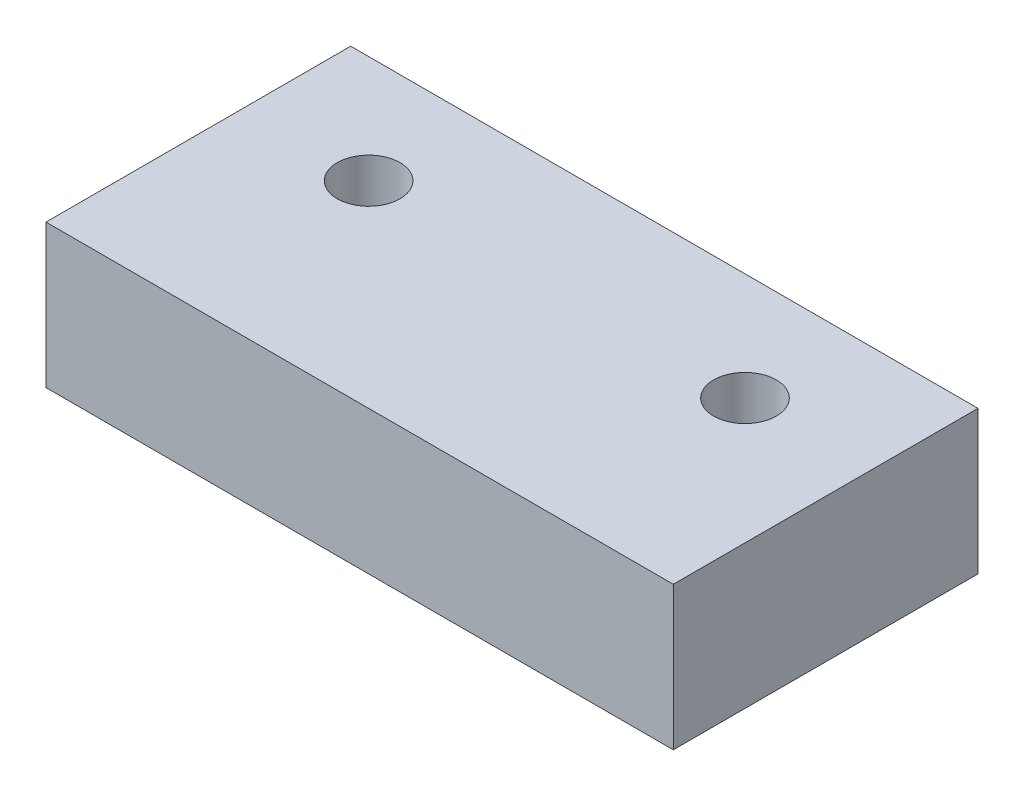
ISO-10303-21;
HEADER;
FILE_DESCRIPTION(('STEP AP214'),'2;1');
FILE_NAME('part.step','',(''),(''),'','','');
FILE_SCHEMA(('AUTOMOTIVE_DESIGN { 1 0 10303 214 1 1 1 1 }'));
ENDSEC;
DATA;
#1=APPLICATION_CONTEXT('core data for automotive mechanical design processes');
#2=APPLICATION_PROTOCOL_DEFINITION('international standard','automotive_design',2000,#1);
#3=PRODUCT_CONTEXT('',#1,'mechanical');
#4=PRODUCT('Part','Part','',(#3));
#5=PRODUCT_RELATED_PRODUCT_CATEGORY('part','',(#4));
#6=PRODUCT_DEFINITION_FORMATION('','',#4);
#7=PRODUCT_DEFINITION_CONTEXT('part definition',#1,'design');
#8=PRODUCT_DEFINITION('design','',#6,#7);
#9=PRODUCT_DEFINITION_SHAPE('','',#8);
#10=(LENGTH_UNIT() NAMED_UNIT(*) SI_UNIT(.MILLI.,.METRE.));
#11=(NAMED_UNIT(*) PLANE_ANGLE_UNIT() SI_UNIT($,.RADIAN.));
#12=(NAMED_UNIT(*) SI_UNIT($,.STERADIAN.) SOLID_ANGLE_UNIT());
#13=UNCERTAINTY_MEASURE_WITH_UNIT(LENGTH_MEASURE(1.E-05),#10,'distance_accuracy_value','');
#14=(GEOMETRIC_REPRESENTATION_CONTEXT(3) GLOBAL_UNCERTAINTY_ASSIGNED_CONTEXT((#13)) GLOBAL_UNIT_ASSIGNED_CONTEXT((#10,
#11,#12)) REPRESENTATION_CONTEXT('',''));
#15=CARTESIAN_POINT('',(0.,0.,0.));
#16=DIRECTION('',(0.,0.,1.));
#17=DIRECTION('',(1.,0.,0.));
#18=AXIS2_PLACEMENT_3D('',#15,#16,#17);
#19=CARTESIAN_POINT('',(10.5,3.,0.));
#20=DIRECTION('',(0.,-1.,0.));
#21=DIRECTION('',(0.,0.,-1.));
#22=AXIS2_PLACEMENT_3D('',#19,#20,#21);
#23=CYLINDRICAL_SURFACE('',#22,3.5);
#24=CARTESIAN_POINT('',(10.5,3.,0.));
#25=DIRECTION('',(0.,-1.,0.));
#26=DIRECTION('',(0.,0.,-1.));
#27=AXIS2_PLACEMENT_3D('',#24,#25,#26);
#28=CIRCLE('',#27,3.5);
#29=CARTESIAN_POINT('',(10.5,3.,-3.5));
#30=VERTEX_POINT('',#29);
#31=EDGE_CURVE('E20',#30,#30,#28,.T.);
#32=ORIENTED_EDGE('',*,*,#31,.F.);
#33=EDGE_LOOP('',(#32));
#34=FACE_BOUND('',#33,.T.);
#35=CARTESIAN_POINT('',(10.5,0.,0.));
#36=DIRECTION('',(0.,-1.,0.));
#37=DIRECTION('',(0.,0.,-1.));
#38=AXIS2_PLACEMENT_3D('',#35,#36,#37);
#39=CIRCLE('',#38,3.5);
#40=CARTESIAN_POINT('',(10.5,0.,-3.5));
#41=VERTEX_POINT('',#40);
#42=EDGE_CURVE('E99',#41,#41,#39,.T.);
#43=ORIENTED_EDGE('',*,*,#42,.T.);
#44=EDGE_LOOP('',(#43));
#45=FACE_BOUND('',#44,.T.);
#46=ADVANCED_FACE('F17',(#34,#45),#23,.F.);
#47=CARTESIAN_POINT('',(-10.5,3.,0.));
#48=DIRECTION('',(0.,-1.,0.));
#49=DIRECTION('',(0.,0.,-1.));
#50=AXIS2_PLACEMENT_3D('',#47,#48,#49);
#51=CYLINDRICAL_SURFACE('',#50,3.5);
#52=CARTESIAN_POINT('',(-10.5,3.,0.));
#53=DIRECTION('',(0.,-1.,0.));
#54=DIRECTION('',(0.,0.,-1.));
#55=AXIS2_PLACEMENT_3D('',#52,#53,#54);
#56=CIRCLE('',#55,3.5);
#57=CARTESIAN_POINT('',(-10.5,3.,-3.5));
#58=VERTEX_POINT('',#57);
#59=EDGE_CURVE('E101',#58,#58,#56,.T.);
#60=ORIENTED_EDGE('',*,*,#59,.F.);
#61=EDGE_LOOP('',(#60));
#62=FACE_BOUND('',#61,.T.);
#63=CARTESIAN_POINT('',(-10.5,0.,0.));
#64=DIRECTION('',(0.,-1.,0.));
#65=DIRECTION('',(0.,0.,-1.));
#66=AXIS2_PLACEMENT_3D('',#63,#64,#65);
#67=CIRCLE('',#66,3.5);
#68=CARTESIAN_POINT('',(-10.5,0.,-3.5));
#69=VERTEX_POINT('',#68);
#70=EDGE_CURVE('E96',#69,#69,#67,.T.);
#71=ORIENTED_EDGE('',*,*,#70,.T.);
#72=EDGE_LOOP('',(#71));
#73=FACE_BOUND('',#72,.T.);
#74=ADVANCED_FACE('F112',(#62,#73),#51,.F.);
#75=CARTESIAN_POINT('',(10.5,3.,0.));
#76=DIRECTION('',(0.,-1.,0.));
#77=DIRECTION('',(0.,0.,-1.));
#78=AXIS2_PLACEMENT_3D('',#75,#76,#77);
#79=PLANE('',#78);
#80=CARTESIAN_POINT('',(10.5,3.,0.));
#81=DIRECTION('',(0.,1.,0.));
#82=DIRECTION('',(0.,0.,1.));
#83=AXIS2_PLACEMENT_3D('',#80,#81,#82);
#84=CIRCLE('',#83,1.75);
#85=CARTESIAN_POINT('',(10.5,3.,1.75));
#86=VERTEX_POINT('',#85);
#87=EDGE_CURVE('E93',#86,#86,#84,.T.);
#88=ORIENTED_EDGE('',*,*,#87,.T.);
#89=EDGE_LOOP('',(#88));
#90=FACE_BOUND('',#89,.T.);
#91=ORIENTED_EDGE('',*,*,#31,.T.);
#92=EDGE_LOOP('',(#91));
#93=FACE_BOUND('',#92,.T.);
#94=ADVANCED_FACE('F108',(#90,#93),#79,.T.);
#95=CARTESIAN_POINT('',(-10.5,3.,0.));
#96=DIRECTION('',(0.,-1.,0.));
#97=DIRECTION('',(0.,0.,-1.));
#98=AXIS2_PLACEMENT_3D('',#95,#96,#97);
#99=PLANE('',#98);
#100=CARTESIAN_POINT('',(-10.5,3.,0.));
#101=DIRECTION('',(0.,1.,0.));
#102=DIRECTION('',(0.,0.,1.));
#103=AXIS2_PLACEMENT_3D('',#100,#101,#102);
#104=CIRCLE('',#103,1.75);
#105=CARTESIAN_POINT('',(-10.5,3.,1.75));
#106=VERTEX_POINT('',#105);
#107=EDGE_CURVE('E69',#106,#106,#104,.T.);
#108=ORIENTED_EDGE('',*,*,#107,.T.);
#109=EDGE_LOOP('',(#108));
#110=FACE_BOUND('',#109,.T.);
#111=ORIENTED_EDGE('',*,*,#59,.T.);
#112=EDGE_LOOP('',(#111));
#113=FACE_BOUND('',#112,.T.);
#114=ADVANCED_FACE('F117',(#110,#113),#99,.T.);
#115=CARTESIAN_POINT('',(0.,0.,0.));
#116=DIRECTION('',(0.,1.,0.));
#117=DIRECTION('',(0.,0.,1.));
#118=AXIS2_PLACEMENT_3D('',#115,#116,#117);
#119=PLANE('',#118);
#120=DIRECTION('',(1.,0.,0.));
#121=VECTOR('',#120,1.);
#122=CARTESIAN_POINT('',(0.,0.,11.));
#123=LINE('',#122,#121);
#124=CARTESIAN_POINT('',(-17.5,0.,11.));
#125=VERTEX_POINT('',#124);
#126=CARTESIAN_POINT('',(17.5,0.,11.));
#127=VERTEX_POINT('',#126);
#128=EDGE_CURVE('E245',#125,#127,#123,.T.);
#129=ORIENTED_EDGE('',*,*,#128,.F.);
#130=DIRECTION('',(0.,0.,-1.));
#131=VECTOR('',#130,1.);
#132=CARTESIAN_POINT('',(-17.5,0.,-6.));
#133=LINE('',#132,#131);
#134=CARTESIAN_POINT('',(-17.5,0.,-6.));
#135=VERTEX_POINT('',#134);
#136=EDGE_CURVE('E73',#125,#135,#133,.T.);
#137=ORIENTED_EDGE('',*,*,#136,.T.);
#138=DIRECTION('',(1.,0.,0.));
#139=VECTOR('',#138,1.);
#140=CARTESIAN_POINT('',(-17.5,0.,-6.));
#141=LINE('',#140,#139);
#142=CARTESIAN_POINT('',(17.5,0.,-6.));
#143=VERTEX_POINT('',#142);
#144=EDGE_CURVE('E55',#135,#143,#141,.T.);
#145=ORIENTED_EDGE('',*,*,#144,.T.);
#146=DIRECTION('',(0.,0.,1.));
#147=VECTOR('',#146,1.);
#148=CARTESIAN_POINT('',(17.5,0.,-6.));
#149=LINE('',#148,#147);
#150=EDGE_CURVE('E60',#143,#127,#149,.T.);
#151=ORIENTED_EDGE('',*,*,#150,.T.);
#152=EDGE_LOOP('',(#129,#137,#145,#151));
#153=FACE_BOUND('',#152,.T.);
#154=ORIENTED_EDGE('',*,*,#70,.F.);
#155=EDGE_LOOP('',(#154));
#156=FACE_BOUND('',#155,.T.);
#157=ORIENTED_EDGE('',*,*,#42,.F.);
#158=EDGE_LOOP('',(#157));
#159=FACE_BOUND('',#158,.T.);
#160=ADVANCED_FACE('F71',(#153,#156,#159),#119,.F.);
#161=CARTESIAN_POINT('',(10.5,0.,0.));
#162=DIRECTION('',(0.,1.,0.));
#163=DIRECTION('',(0.,0.,1.));
#164=AXIS2_PLACEMENT_3D('',#161,#162,#163);
#165=CYLINDRICAL_SURFACE('',#164,1.75);
#166=CARTESIAN_POINT('',(10.5,8.,0.));
#167=DIRECTION('',(0.,1.,0.));
#168=DIRECTION('',(0.,0.,1.));
#169=AXIS2_PLACEMENT_3D('',#166,#167,#168);
#170=CIRCLE('',#169,1.75);
#171=CARTESIAN_POINT('',(10.5,8.,1.75));
#172=VERTEX_POINT('',#171);
#173=EDGE_CURVE('E88',#172,#172,#170,.F.);
#174=ORIENTED_EDGE('',*,*,#173,.F.);
#175=EDGE_LOOP('',(#174));
#176=FACE_BOUND('',#175,.T.);
#177=ORIENTED_EDGE('',*,*,#87,.F.);
#178=EDGE_LOOP('',(#177));
#179=FACE_BOUND('',#178,.T.);
#180=ADVANCED_FACE('F116',(#176,#179),#165,.F.);
#181=CARTESIAN_POINT('',(-10.5,0.,0.));
#182=DIRECTION('',(0.,1.,0.));
#183=DIRECTION('',(0.,0.,1.));
#184=AXIS2_PLACEMENT_3D('',#181,#182,#183);
#185=CYLINDRICAL_SURFACE('',#184,1.75);
#186=CARTESIAN_POINT('',(-10.5,8.,0.));
#187=DIRECTION('',(0.,1.,0.));
#188=DIRECTION('',(0.,0.,1.));
#189=AXIS2_PLACEMENT_3D('',#186,#187,#188);
#190=CIRCLE('',#189,1.75);
#191=CARTESIAN_POINT('',(-10.5,8.,1.75));
#192=VERTEX_POINT('',#191);
#193=EDGE_CURVE('E84',#192,#192,#190,.F.);
#194=ORIENTED_EDGE('',*,*,#193,.F.);
#195=EDGE_LOOP('',(#194));
#196=FACE_BOUND('',#195,.T.);
#197=ORIENTED_EDGE('',*,*,#107,.F.);
#198=EDGE_LOOP('',(#197));
#199=FACE_BOUND('',#198,.T.);
#200=ADVANCED_FACE('F124',(#196,#199),#185,.F.);
#201=CARTESIAN_POINT('',(17.5,8.,-6.));
#202=DIRECTION('',(-1.,0.,0.));
#203=DIRECTION('',(0.,0.,1.));
#204=AXIS2_PLACEMENT_3D('',#201,#202,#203);
#205=PLANE('',#204);
#206=DIRECTION('',(0.,1.,0.));
#207=VECTOR('',#206,1.);
#208=CARTESIAN_POINT('',(17.5,8.,-6.));
#209=LINE('',#208,#207);
#210=CARTESIAN_POINT('',(17.5,8.,-6.));
#211=VERTEX_POINT('',#210);
#212=EDGE_CURVE('E62',#143,#211,#209,.T.);
#213=ORIENTED_EDGE('',*,*,#212,.T.);
#214=DIRECTION('',(0.,0.,1.));
#215=VECTOR('',#214,1.);
#216=CARTESIAN_POINT('',(17.5,8.,0.));
#217=LINE('',#216,#215);
#218=CARTESIAN_POINT('',(17.5,8.,11.));
#219=VERTEX_POINT('',#218);
#220=EDGE_CURVE('E87',#219,#211,#217,.F.);
#221=ORIENTED_EDGE('',*,*,#220,.F.);
#222=DIRECTION('',(0.,1.,0.));
#223=VECTOR('',#222,1.);
#224=CARTESIAN_POINT('',(17.5,0.,11.));
#225=LINE('',#224,#223);
#226=EDGE_CURVE('E65',#127,#219,#225,.T.);
#227=ORIENTED_EDGE('',*,*,#226,.F.);
#228=ORIENTED_EDGE('',*,*,#150,.F.);
#229=EDGE_LOOP('',(#213,#221,#227,#228));
#230=FACE_BOUND('',#229,.T.);
#231=ADVANCED_FACE('F61',(#230),#205,.F.);
#232=CARTESIAN_POINT('',(-17.5,8.,-6.));
#233=DIRECTION('',(0.,0.,1.));
#234=DIRECTION('',(1.,0.,0.));
#235=AXIS2_PLACEMENT_3D('',#232,#233,#234);
#236=PLANE('',#235);
#237=DIRECTION('',(0.,1.,0.));
#238=VECTOR('',#237,1.);
#239=CARTESIAN_POINT('',(-17.5,8.,-6.));
#240=LINE('',#239,#238);
#241=CARTESIAN_POINT('',(-17.5,8.,-6.));
#242=VERTEX_POINT('',#241);
#243=EDGE_CURVE('E75',#135,#242,#240,.T.);
#244=ORIENTED_EDGE('',*,*,#243,.T.);
#245=DIRECTION('',(1.,0.,0.));
#246=VECTOR('',#245,1.);
#247=CARTESIAN_POINT('',(0.,8.,-6.));
#248=LINE('',#247,#246);
#249=EDGE_CURVE('E79',#211,#242,#248,.F.);
#250=ORIENTED_EDGE('',*,*,#249,.F.);
#251=ORIENTED_EDGE('',*,*,#212,.F.);
#252=ORIENTED_EDGE('',*,*,#144,.F.);
#253=EDGE_LOOP('',(#244,#250,#251,#252));
#254=FACE_BOUND('',#253,.T.);
#255=ADVANCED_FACE('F77',(#254),#236,.F.);
#256=CARTESIAN_POINT('',(-17.5,8.,-6.));
#257=DIRECTION('',(1.,0.,0.));
#258=DIRECTION('',(0.,0.,-1.));
#259=AXIS2_PLACEMENT_3D('',#256,#257,#258);
#260=PLANE('',#259);
#261=DIRECTION('',(0.,1.,0.));
#262=VECTOR('',#261,1.);
#263=CARTESIAN_POINT('',(-17.5,0.,11.));
#264=LINE('',#263,#262);
#265=CARTESIAN_POINT('',(-17.5,8.,11.));
#266=VERTEX_POINT('',#265);
#267=EDGE_CURVE('E35',#266,#125,#264,.F.);
#268=ORIENTED_EDGE('',*,*,#267,.F.);
#269=DIRECTION('',(0.,0.,1.));
#270=VECTOR('',#269,1.);
#271=CARTESIAN_POINT('',(-17.5,8.,0.));
#272=LINE('',#271,#270);
#273=EDGE_CURVE('E26',#242,#266,#272,.T.);
#274=ORIENTED_EDGE('',*,*,#273,.F.);
#275=ORIENTED_EDGE('',*,*,#243,.F.);
#276=ORIENTED_EDGE('',*,*,#136,.F.);
#277=EDGE_LOOP('',(#268,#274,#275,#276));
#278=FACE_BOUND('',#277,.T.);
#279=ADVANCED_FACE('F137',(#278),#260,.F.);
#280=CARTESIAN_POINT('',(0.,0.,11.));
#281=DIRECTION('',(0.,0.,1.));
#282=DIRECTION('',(1.,0.,0.));
#283=AXIS2_PLACEMENT_3D('',#280,#281,#282);
#284=PLANE('',#283);
#285=ORIENTED_EDGE('',*,*,#226,.T.);
#286=DIRECTION('',(1.,0.,0.));
#287=VECTOR('',#286,1.);
#288=CARTESIAN_POINT('',(0.,8.,11.));
#289=LINE('',#288,#287);
#290=EDGE_CURVE('E11',#266,#219,#289,.T.);
#291=ORIENTED_EDGE('',*,*,#290,.F.);
#292=ORIENTED_EDGE('',*,*,#267,.T.);
#293=ORIENTED_EDGE('',*,*,#128,.T.);
#294=EDGE_LOOP('',(#285,#291,#292,#293));
#295=FACE_BOUND('',#294,.T.);
#296=ADVANCED_FACE('F131',(#295),#284,.T.);
#297=CARTESIAN_POINT('',(0.,8.,0.));
#298=DIRECTION('',(0.,1.,0.));
#299=DIRECTION('',(0.,0.,1.));
#300=AXIS2_PLACEMENT_3D('',#297,#298,#299);
#301=PLANE('',#300);
#302=ORIENTED_EDGE('',*,*,#273,.T.);
#303=ORIENTED_EDGE('',*,*,#290,.T.);
#304=ORIENTED_EDGE('',*,*,#220,.T.);
#305=ORIENTED_EDGE('',*,*,#249,.T.);
#306=EDGE_LOOP('',(#302,#303,#304,#305));
#307=FACE_BOUND('',#306,.T.);
#308=ORIENTED_EDGE('',*,*,#193,.T.);
#309=EDGE_LOOP('',(#308));
#310=FACE_BOUND('',#309,.T.);
#311=ORIENTED_EDGE('',*,*,#173,.T.);
#312=EDGE_LOOP('',(#311));
#313=FACE_BOUND('',#312,.T.);
#314=ADVANCED_FACE('F129',(#307,#310,#313),#301,.T.);
#315=CLOSED_SHELL('',(#46,#74,#94,#114,#160,#180,#200,#231,#255,#279,#296,#314));
#316=MANIFOLD_SOLID_BREP('B1',#315);
#317=ADVANCED_BREP_SHAPE_REPRESENTATION('',(#18,#316),#14);
#318=SHAPE_DEFINITION_REPRESENTATION(#9,#317);
ENDSEC;
END-ISO-10303-21;
